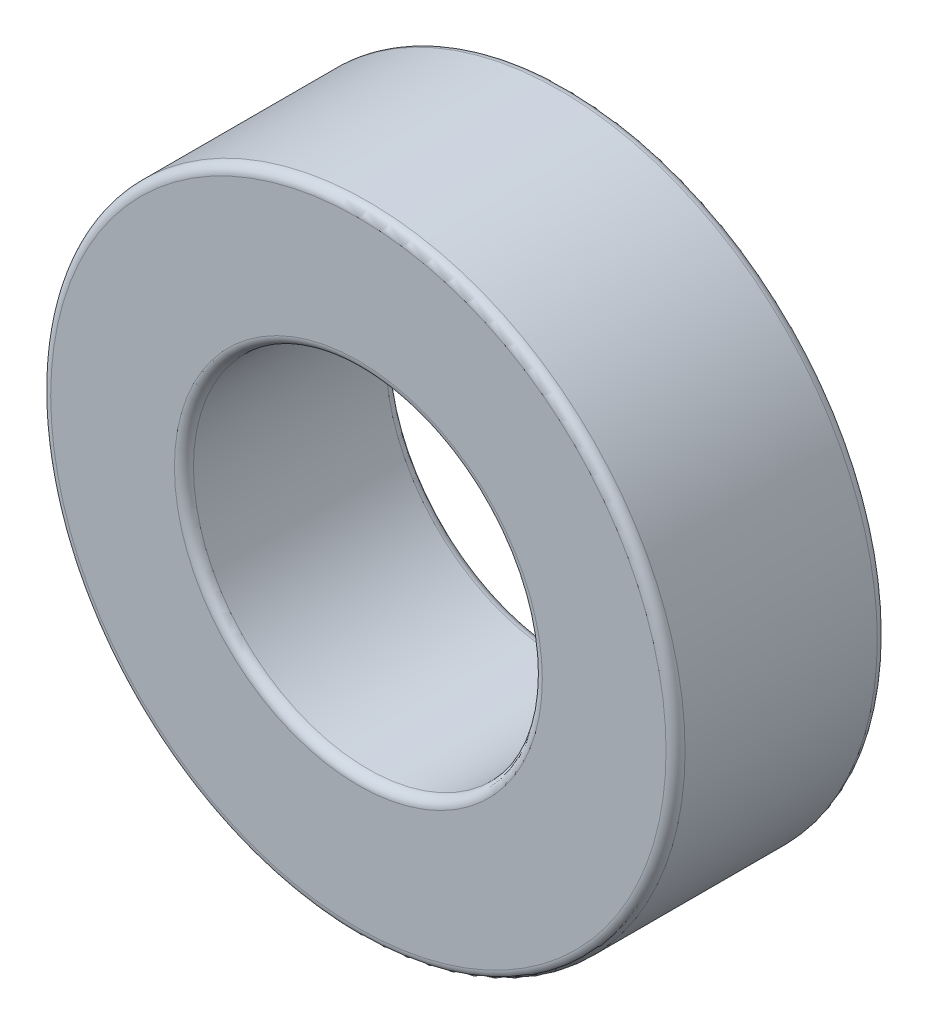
ISO-10303-21;
HEADER;
FILE_DESCRIPTION(('STEP AP214'),'2;1');
FILE_NAME('part.step','',(''),(''),'','','');
FILE_SCHEMA(('AUTOMOTIVE_DESIGN { 1 0 10303 214 1 1 1 1 }'));
ENDSEC;
DATA;
#1=APPLICATION_CONTEXT('core data for automotive mechanical design processes');
#2=APPLICATION_PROTOCOL_DEFINITION('international standard','automotive_design',2000,#1);
#3=PRODUCT_CONTEXT('',#1,'mechanical');
#4=PRODUCT('Part','Part','',(#3));
#5=PRODUCT_RELATED_PRODUCT_CATEGORY('part','',(#4));
#6=PRODUCT_DEFINITION_FORMATION('','',#4);
#7=PRODUCT_DEFINITION_CONTEXT('part definition',#1,'design');
#8=PRODUCT_DEFINITION('design','',#6,#7);
#9=PRODUCT_DEFINITION_SHAPE('','',#8);
#10=(LENGTH_UNIT() NAMED_UNIT(*) SI_UNIT(.MILLI.,.METRE.));
#11=(NAMED_UNIT(*) PLANE_ANGLE_UNIT() SI_UNIT($,.RADIAN.));
#12=(NAMED_UNIT(*) SI_UNIT($,.STERADIAN.) SOLID_ANGLE_UNIT());
#13=UNCERTAINTY_MEASURE_WITH_UNIT(LENGTH_MEASURE(1.E-05),#10,'distance_accuracy_value','');
#14=(GEOMETRIC_REPRESENTATION_CONTEXT(3) GLOBAL_UNCERTAINTY_ASSIGNED_CONTEXT((#13)) GLOBAL_UNIT_ASSIGNED_CONTEXT((#10,
#11,#12)) REPRESENTATION_CONTEXT('',''));
#15=CARTESIAN_POINT('',(0.,0.,0.));
#16=DIRECTION('',(0.,0.,1.));
#17=DIRECTION('',(1.,0.,0.));
#18=AXIS2_PLACEMENT_3D('',#15,#16,#17);
#19=CARTESIAN_POINT('',(0.,0.,-31.8));
#20=DIRECTION('',(0.,0.,1.));
#21=DIRECTION('',(1.,0.,0.));
#22=AXIS2_PLACEMENT_3D('',#19,#20,#21);
#23=TOROIDAL_SURFACE('',#22,48.5,1.50000000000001);
#24=CARTESIAN_POINT('',(0.,0.,-31.8));
#25=DIRECTION('',(0.,0.,1.));
#26=DIRECTION('',(1.,0.,0.));
#27=AXIS2_PLACEMENT_3D('',#24,#25,#26);
#28=CIRCLE('',#27,50.);
#29=CARTESIAN_POINT('',(50.,0.,-31.8));
#30=VERTEX_POINT('',#29);
#31=EDGE_CURVE('E10',#30,#30,#28,.T.);
#32=ORIENTED_EDGE('',*,*,#31,.F.);
#33=EDGE_LOOP('',(#32));
#34=FACE_BOUND('',#33,.T.);
#35=CARTESIAN_POINT('',(0.,0.,-33.3));
#36=DIRECTION('',(0.,0.,1.));
#37=DIRECTION('',(1.,0.,0.));
#38=AXIS2_PLACEMENT_3D('',#35,#36,#37);
#39=CIRCLE('',#38,48.5);
#40=CARTESIAN_POINT('',(48.5,0.,-33.3));
#41=VERTEX_POINT('',#40);
#42=EDGE_CURVE('E470',#41,#41,#39,.T.);
#43=ORIENTED_EDGE('',*,*,#42,.T.);
#44=EDGE_LOOP('',(#43));
#45=FACE_BOUND('',#44,.T.);
#46=ADVANCED_FACE('F442',(#34,#45),#23,.T.);
#47=CARTESIAN_POINT('',(0.,0.,112.247372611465));
#48=DIRECTION('',(0.,0.,1.));
#49=DIRECTION('',(1.,0.,0.));
#50=AXIS2_PLACEMENT_3D('',#47,#48,#49);
#51=CYLINDRICAL_SURFACE('',#50,50.);
#52=CARTESIAN_POINT('',(0.,0.,-1.5));
#53=DIRECTION('',(0.,0.,1.));
#54=DIRECTION('',(1.,0.,0.));
#55=AXIS2_PLACEMENT_3D('',#52,#53,#54);
#56=CIRCLE('',#55,50.);
#57=CARTESIAN_POINT('',(50.,0.,-1.5));
#58=VERTEX_POINT('',#57);
#59=EDGE_CURVE('E448',#58,#58,#56,.T.);
#60=ORIENTED_EDGE('',*,*,#59,.F.);
#61=EDGE_LOOP('',(#60));
#62=FACE_BOUND('',#61,.T.);
#63=ORIENTED_EDGE('',*,*,#31,.T.);
#64=EDGE_LOOP('',(#63));
#65=FACE_BOUND('',#64,.T.);
#66=ADVANCED_FACE('F585',(#62,#65),#51,.T.);
#67=CARTESIAN_POINT('',(0.,0.,-1.5));
#68=DIRECTION('',(0.,0.,1.));
#69=DIRECTION('',(1.,0.,0.));
#70=AXIS2_PLACEMENT_3D('',#67,#68,#69);
#71=TOROIDAL_SURFACE('',#70,48.5,1.50000000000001);
#72=ORIENTED_EDGE('',*,*,#59,.T.);
#73=EDGE_LOOP('',(#72));
#74=FACE_BOUND('',#73,.T.);
#75=CARTESIAN_POINT('',(0.,0.,0.));
#76=DIRECTION('',(0.,0.,1.));
#77=DIRECTION('',(1.,0.,0.));
#78=AXIS2_PLACEMENT_3D('',#75,#76,#77);
#79=CIRCLE('',#78,48.5);
#80=CARTESIAN_POINT('',(48.5,0.,0.));
#81=VERTEX_POINT('',#80);
#82=EDGE_CURVE('E452',#81,#81,#79,.T.);
#83=ORIENTED_EDGE('',*,*,#82,.F.);
#84=EDGE_LOOP('',(#83));
#85=FACE_BOUND('',#84,.T.);
#86=ADVANCED_FACE('F582',(#74,#85),#71,.T.);
#87=CARTESIAN_POINT('',(0.,48.5,0.));
#88=DIRECTION('',(0.,0.,-1.));
#89=DIRECTION('',(-1.,0.,0.));
#90=AXIS2_PLACEMENT_3D('',#87,#88,#89);
#91=PLANE('',#90);
#92=CARTESIAN_POINT('',(0.,0.,0.));
#93=DIRECTION('',(0.,0.,1.));
#94=DIRECTION('',(1.,0.,0.));
#95=AXIS2_PLACEMENT_3D('',#92,#93,#94);
#96=CIRCLE('',#95,29.);
#97=CARTESIAN_POINT('',(29.,0.,0.));
#98=VERTEX_POINT('',#97);
#99=EDGE_CURVE('E456',#98,#98,#96,.T.);
#100=ORIENTED_EDGE('',*,*,#99,.F.);
#101=EDGE_LOOP('',(#100));
#102=FACE_BOUND('',#101,.T.);
#103=ORIENTED_EDGE('',*,*,#82,.T.);
#104=EDGE_LOOP('',(#103));
#105=FACE_BOUND('',#104,.T.);
#106=ADVANCED_FACE('F578',(#102,#105),#91,.F.);
#107=CARTESIAN_POINT('',(0.,0.,-1.5));
#108=DIRECTION('',(0.,0.,1.));
#109=DIRECTION('',(1.,0.,0.));
#110=AXIS2_PLACEMENT_3D('',#107,#108,#109);
#111=TOROIDAL_SURFACE('',#110,29.,1.50000000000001);
#112=CARTESIAN_POINT('',(0.,0.,-1.5));
#113=DIRECTION('',(0.,0.,1.));
#114=DIRECTION('',(1.,0.,0.));
#115=AXIS2_PLACEMENT_3D('',#112,#113,#114);
#116=CIRCLE('',#115,27.5);
#117=CARTESIAN_POINT('',(27.5,0.,-1.5));
#118=VERTEX_POINT('',#117);
#119=EDGE_CURVE('E461',#118,#118,#116,.T.);
#120=ORIENTED_EDGE('',*,*,#119,.F.);
#121=EDGE_LOOP('',(#120));
#122=FACE_BOUND('',#121,.T.);
#123=ORIENTED_EDGE('',*,*,#99,.T.);
#124=EDGE_LOOP('',(#123));
#125=FACE_BOUND('',#124,.T.);
#126=ADVANCED_FACE('F574',(#122,#125),#111,.T.);
#127=CARTESIAN_POINT('',(0.,0.,112.247372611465));
#128=DIRECTION('',(0.,0.,1.));
#129=DIRECTION('',(1.,0.,0.));
#130=AXIS2_PLACEMENT_3D('',#127,#128,#129);
#131=CYLINDRICAL_SURFACE('',#130,27.5);
#132=ORIENTED_EDGE('',*,*,#119,.T.);
#133=EDGE_LOOP('',(#132));
#134=FACE_BOUND('',#133,.T.);
#135=CARTESIAN_POINT('',(0.,0.,-31.8));
#136=DIRECTION('',(0.,0.,1.));
#137=DIRECTION('',(1.,0.,0.));
#138=AXIS2_PLACEMENT_3D('',#135,#136,#137);
#139=CIRCLE('',#138,27.5);
#140=CARTESIAN_POINT('',(27.5,0.,-31.8));
#141=VERTEX_POINT('',#140);
#142=EDGE_CURVE('E464',#141,#141,#139,.T.);
#143=ORIENTED_EDGE('',*,*,#142,.F.);
#144=EDGE_LOOP('',(#143));
#145=FACE_BOUND('',#144,.T.);
#146=ADVANCED_FACE('F570',(#134,#145),#131,.F.);
#147=CARTESIAN_POINT('',(0.,0.,-31.8));
#148=DIRECTION('',(0.,0.,1.));
#149=DIRECTION('',(1.,0.,0.));
#150=AXIS2_PLACEMENT_3D('',#147,#148,#149);
#151=TOROIDAL_SURFACE('',#150,29.,1.50000000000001);
#152=ORIENTED_EDGE('',*,*,#142,.T.);
#153=EDGE_LOOP('',(#152));
#154=FACE_BOUND('',#153,.T.);
#155=CARTESIAN_POINT('',(0.,0.,-33.3));
#156=DIRECTION('',(0.,0.,1.));
#157=DIRECTION('',(1.,0.,0.));
#158=AXIS2_PLACEMENT_3D('',#155,#156,#157);
#159=CIRCLE('',#158,29.);
#160=CARTESIAN_POINT('',(29.,0.,-33.3));
#161=VERTEX_POINT('',#160);
#162=EDGE_CURVE('E467',#161,#161,#159,.T.);
#163=ORIENTED_EDGE('',*,*,#162,.F.);
#164=EDGE_LOOP('',(#163));
#165=FACE_BOUND('',#164,.T.);
#166=ADVANCED_FACE('F566',(#154,#165),#151,.T.);
#167=CARTESIAN_POINT('',(0.,48.5,-33.3));
#168=DIRECTION('',(0.,0.,-1.));
#169=DIRECTION('',(-1.,0.,0.));
#170=AXIS2_PLACEMENT_3D('',#167,#168,#169);
#171=PLANE('',#170);
#172=ORIENTED_EDGE('',*,*,#162,.T.);
#173=EDGE_LOOP('',(#172));
#174=FACE_BOUND('',#173,.T.);
#175=ORIENTED_EDGE('',*,*,#42,.F.);
#176=EDGE_LOOP('',(#175));
#177=FACE_BOUND('',#176,.T.);
#178=ADVANCED_FACE('F563',(#174,#177),#171,.T.);
#179=CLOSED_SHELL('',(#46,#66,#86,#106,#126,#146,#166,#178));
#180=CARTESIAN_POINT('',(0.,0.,-16.65));
#181=DIRECTION('',(0.,0.,-1.));
#182=DIRECTION('',(-1.,0.,0.));
#183=AXIS2_PLACEMENT_3D('',#180,#181,#182);
#184=CONICAL_SURFACE('',#183,38.7558140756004,0.535562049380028);
#185=CARTESIAN_POINT('',(0.,0.,-23.3031484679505));
#186=DIRECTION('',(0.,0.,1.));
#187=DIRECTION('',(1.,0.,0.));
#188=AXIS2_PLACEMENT_3D('',#185,#186,#187);
#189=CIRCLE('',#188,42.7038789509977);
#190=CARTESIAN_POINT('',(42.7038789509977,0.,-23.3031484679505));
#191=VERTEX_POINT('',#190);
#192=EDGE_CURVE('E536',#191,#191,#189,.T.);
#193=ORIENTED_EDGE('',*,*,#192,.F.);
#194=EDGE_LOOP('',(#193));
#195=FACE_BOUND('',#194,.T.);
#196=CARTESIAN_POINT('',(0.,0.,-16.65));
#197=DIRECTION('',(0.,0.,1.));
#198=DIRECTION('',(1.,0.,0.));
#199=AXIS2_PLACEMENT_3D('',#196,#197,#198);
#200=CIRCLE('',#199,38.7558140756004);
#201=CARTESIAN_POINT('',(38.7558140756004,0.,-16.65));
#202=VERTEX_POINT('',#201);
#203=EDGE_CURVE('E473',#202,#202,#200,.T.);
#204=ORIENTED_EDGE('',*,*,#203,.T.);
#205=EDGE_LOOP('',(#204));
#206=FACE_BOUND('',#205,.T.);
#207=ADVANCED_FACE('F542',(#195,#206),#184,.F.);
#208=CARTESIAN_POINT('',(0.,0.,-16.65));
#209=DIRECTION('',(0.,0.,1.));
#210=DIRECTION('',(1.,0.,0.));
#211=AXIS2_PLACEMENT_3D('',#208,#209,#210);
#212=CONICAL_SURFACE('',#211,38.7558140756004,0.535562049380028);
#213=CARTESIAN_POINT('',(0.,0.,-9.99685153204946));
#214=DIRECTION('',(0.,0.,1.));
#215=DIRECTION('',(1.,0.,0.));
#216=AXIS2_PLACEMENT_3D('',#213,#214,#215);
#217=CIRCLE('',#216,42.7038789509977);
#218=CARTESIAN_POINT('',(42.7038789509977,0.,-9.99685153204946));
#219=VERTEX_POINT('',#218);
#220=EDGE_CURVE('E476',#219,#219,#217,.T.);
#221=ORIENTED_EDGE('',*,*,#220,.T.);
#222=EDGE_LOOP('',(#221));
#223=FACE_BOUND('',#222,.T.);
#224=ORIENTED_EDGE('',*,*,#203,.F.);
#225=EDGE_LOOP('',(#224));
#226=FACE_BOUND('',#225,.T.);
#227=ADVANCED_FACE('F545',(#223,#226),#212,.F.);
#228=CARTESIAN_POINT('',(0.,0.,-9.99685153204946));
#229=DIRECTION('',(0.,0.,-1.));
#230=DIRECTION('',(-1.,0.,0.));
#231=AXIS2_PLACEMENT_3D('',#228,#229,#230);
#232=CONICAL_SURFACE('',#231,42.7038789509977,1.03523427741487);
#233=CARTESIAN_POINT('',(0.,0.,-12.1185255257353));
#234=DIRECTION('',(0.,0.,1.));
#235=DIRECTION('',(1.,0.,0.));
#236=AXIS2_PLACEMENT_3D('',#233,#234,#235);
#237=CIRCLE('',#236,46.279253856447);
#238=CARTESIAN_POINT('',(46.279253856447,0.,-12.1185255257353));
#239=VERTEX_POINT('',#238);
#240=EDGE_CURVE('E479',#239,#239,#237,.T.);
#241=ORIENTED_EDGE('',*,*,#240,.T.);
#242=EDGE_LOOP('',(#241));
#243=FACE_BOUND('',#242,.T.);
#244=ORIENTED_EDGE('',*,*,#220,.F.);
#245=EDGE_LOOP('',(#244));
#246=FACE_BOUND('',#245,.T.);
#247=ADVANCED_FACE('F551',(#243,#246),#232,.T.);
#248=CARTESIAN_POINT('',(0.,0.,-12.1185255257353));
#249=DIRECTION('',(0.,0.,1.));
#250=DIRECTION('',(1.,0.,0.));
#251=AXIS2_PLACEMENT_3D('',#248,#249,#250);
#252=CONICAL_SURFACE('',#251,46.279253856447,0.535562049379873);
#253=CARTESIAN_POINT('',(0.,0.,-12.1099257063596));
#254=DIRECTION('',(0.,0.,1.));
#255=DIRECTION('',(1.,0.,0.));
#256=AXIS2_PLACEMENT_3D('',#253,#254,#255);
#257=CIRCLE('',#256,46.2843571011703);
#258=CARTESIAN_POINT('',(46.2843571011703,0.,-12.1099257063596));
#259=VERTEX_POINT('',#258);
#260=EDGE_CURVE('E482',#259,#259,#257,.T.);
#261=ORIENTED_EDGE('',*,*,#260,.T.);
#262=EDGE_LOOP('',(#261));
#263=FACE_BOUND('',#262,.T.);
#264=ORIENTED_EDGE('',*,*,#240,.F.);
#265=EDGE_LOOP('',(#264));
#266=FACE_BOUND('',#265,.T.);
#267=ADVANCED_FACE('F557',(#263,#266),#252,.F.);
#268=CARTESIAN_POINT('',(0.,0.,-9.98825171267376));
#269=DIRECTION('',(0.,0.,-1.));
#270=DIRECTION('',(-1.,0.,0.));
#271=AXIS2_PLACEMENT_3D('',#268,#269,#270);
#272=CONICAL_SURFACE('',#271,42.7089821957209,1.03523427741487);
#273=ORIENTED_EDGE('',*,*,#260,.F.);
#274=EDGE_LOOP('',(#273));
#275=FACE_BOUND('',#274,.T.);
#276=CARTESIAN_POINT('',(0.,0.,-9.98825171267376));
#277=DIRECTION('',(0.,0.,1.));
#278=DIRECTION('',(1.,0.,0.));
#279=AXIS2_PLACEMENT_3D('',#276,#277,#278);
#280=CIRCLE('',#279,42.7089821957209);
#281=CARTESIAN_POINT('',(42.7089821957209,0.,-9.98825171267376));
#282=VERTEX_POINT('',#281);
#283=EDGE_CURVE('E485',#282,#282,#280,.T.);
#284=ORIENTED_EDGE('',*,*,#283,.T.);
#285=EDGE_LOOP('',(#284));
#286=FACE_BOUND('',#285,.T.);
#287=ADVANCED_FACE('F640',(#275,#286),#272,.F.);
#288=CARTESIAN_POINT('',(0.,0.,-3.33510324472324));
#289=DIRECTION('',(0.,0.,1.));
#290=DIRECTION('',(1.,0.,0.));
#291=AXIS2_PLACEMENT_3D('',#288,#289,#290);
#292=CONICAL_SURFACE('',#291,46.6570470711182,0.535562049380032);
#293=ORIENTED_EDGE('',*,*,#283,.F.);
#294=EDGE_LOOP('',(#293));
#295=FACE_BOUND('',#294,.T.);
#296=CARTESIAN_POINT('',(0.,0.,-3.33510324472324));
#297=DIRECTION('',(0.,0.,1.));
#298=DIRECTION('',(1.,0.,0.));
#299=AXIS2_PLACEMENT_3D('',#296,#297,#298);
#300=CIRCLE('',#299,46.6570470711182);
#301=CARTESIAN_POINT('',(46.6570470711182,0.,-3.33510324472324));
#302=VERTEX_POINT('',#301);
#303=EDGE_CURVE('E488',#302,#302,#300,.T.);
#304=ORIENTED_EDGE('',*,*,#303,.T.);
#305=EDGE_LOOP('',(#304));
#306=FACE_BOUND('',#305,.T.);
#307=ADVANCED_FACE('F647',(#295,#306),#292,.F.);
#308=CARTESIAN_POINT('',(0.,0.,-3.32999999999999));
#309=DIRECTION('',(0.,0.,-1.));
#310=DIRECTION('',(-1.,0.,0.));
#311=AXIS2_PLACEMENT_3D('',#308,#309,#310);
#312=CONICAL_SURFACE('',#311,46.6484472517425,1.0352342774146);
#313=ORIENTED_EDGE('',*,*,#303,.F.);
#314=EDGE_LOOP('',(#313));
#315=FACE_BOUND('',#314,.T.);
#316=CARTESIAN_POINT('',(0.,0.,-3.32999999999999));
#317=DIRECTION('',(0.,0.,1.));
#318=DIRECTION('',(1.,0.,0.));
#319=AXIS2_PLACEMENT_3D('',#316,#317,#318);
#320=CIRCLE('',#319,46.6484472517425);
#321=CARTESIAN_POINT('',(46.6484472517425,0.,-3.32999999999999));
#322=VERTEX_POINT('',#321);
#323=EDGE_CURVE('E491',#322,#322,#320,.T.);
#324=ORIENTED_EDGE('',*,*,#323,.T.);
#325=EDGE_LOOP('',(#324));
#326=FACE_BOUND('',#325,.T.);
#327=ADVANCED_FACE('F655',(#315,#326),#312,.F.);
#328=CARTESIAN_POINT('',(0.,0.,-3.32999999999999));
#329=DIRECTION('',(0.,0.,1.));
#330=DIRECTION('',(1.,0.,0.));
#331=AXIS2_PLACEMENT_3D('',#328,#329,#330);
#332=CONICAL_SURFACE('',#331,46.6484472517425,0.535562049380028);
#333=CARTESIAN_POINT('',(0.,0.,-9.98314846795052));
#334=DIRECTION('',(0.,0.,1.));
#335=DIRECTION('',(1.,0.,0.));
#336=AXIS2_PLACEMENT_3D('',#333,#334,#335);
#337=CIRCLE('',#336,42.7003823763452);
#338=CARTESIAN_POINT('',(42.7003823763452,0.,-9.98314846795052));
#339=VERTEX_POINT('',#338);
#340=EDGE_CURVE('E494',#339,#339,#337,.T.);
#341=ORIENTED_EDGE('',*,*,#340,.T.);
#342=EDGE_LOOP('',(#341));
#343=FACE_BOUND('',#342,.T.);
#344=ORIENTED_EDGE('',*,*,#323,.F.);
#345=EDGE_LOOP('',(#344));
#346=FACE_BOUND('',#345,.T.);
#347=ADVANCED_FACE('F663',(#343,#346),#332,.T.);
#348=CARTESIAN_POINT('',(0.,0.,-9.98314846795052));
#349=DIRECTION('',(0.,0.,-1.));
#350=DIRECTION('',(-1.,0.,0.));
#351=AXIS2_PLACEMENT_3D('',#348,#349,#350);
#352=CONICAL_SURFACE('',#351,42.7003823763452,1.03523427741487);
#353=CARTESIAN_POINT('',(0.,0.,-7.86147447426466));
#354=DIRECTION('',(0.,0.,1.));
#355=DIRECTION('',(1.,0.,0.));
#356=AXIS2_PLACEMENT_3D('',#353,#354,#355);
#357=CIRCLE('',#356,39.1250074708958);
#358=CARTESIAN_POINT('',(39.1250074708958,0.,-7.86147447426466));
#359=VERTEX_POINT('',#358);
#360=EDGE_CURVE('E497',#359,#359,#357,.T.);
#361=ORIENTED_EDGE('',*,*,#360,.T.);
#362=EDGE_LOOP('',(#361));
#363=FACE_BOUND('',#362,.T.);
#364=ORIENTED_EDGE('',*,*,#340,.F.);
#365=EDGE_LOOP('',(#364));
#366=FACE_BOUND('',#365,.T.);
#367=ADVANCED_FACE('F671',(#363,#366),#352,.F.);
#368=CARTESIAN_POINT('',(0.,0.,-7.87007429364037));
#369=DIRECTION('',(0.,0.,1.));
#370=DIRECTION('',(1.,0.,0.));
#371=AXIS2_PLACEMENT_3D('',#368,#369,#370);
#372=CONICAL_SURFACE('',#371,39.1199042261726,0.53556204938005);
#373=ORIENTED_EDGE('',*,*,#360,.F.);
#374=EDGE_LOOP('',(#373));
#375=FACE_BOUND('',#374,.T.);
#376=CARTESIAN_POINT('',(0.,0.,-7.87007429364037));
#377=DIRECTION('',(0.,0.,1.));
#378=DIRECTION('',(1.,0.,0.));
#379=AXIS2_PLACEMENT_3D('',#376,#377,#378);
#380=CIRCLE('',#379,39.1199042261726);
#381=CARTESIAN_POINT('',(39.1199042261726,0.,-7.87007429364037));
#382=VERTEX_POINT('',#381);
#383=EDGE_CURVE('E500',#382,#382,#380,.T.);
#384=ORIENTED_EDGE('',*,*,#383,.T.);
#385=EDGE_LOOP('',(#384));
#386=FACE_BOUND('',#385,.T.);
#387=ADVANCED_FACE('F679',(#375,#386),#372,.T.);
#388=CARTESIAN_POINT('',(0.,0.,-9.99174828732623));
#389=DIRECTION('',(0.,0.,-1.));
#390=DIRECTION('',(-1.,0.,0.));
#391=AXIS2_PLACEMENT_3D('',#388,#389,#390);
#392=CONICAL_SURFACE('',#391,42.695279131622,1.03523427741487);
#393=ORIENTED_EDGE('',*,*,#383,.F.);
#394=EDGE_LOOP('',(#393));
#395=FACE_BOUND('',#394,.T.);
#396=CARTESIAN_POINT('',(0.,0.,-9.99174828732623));
#397=DIRECTION('',(0.,0.,1.));
#398=DIRECTION('',(1.,0.,0.));
#399=AXIS2_PLACEMENT_3D('',#396,#397,#398);
#400=CIRCLE('',#399,42.695279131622);
#401=CARTESIAN_POINT('',(42.695279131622,0.,-9.99174828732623));
#402=VERTEX_POINT('',#401);
#403=EDGE_CURVE('E503',#402,#402,#400,.T.);
#404=ORIENTED_EDGE('',*,*,#403,.T.);
#405=EDGE_LOOP('',(#404));
#406=FACE_BOUND('',#405,.T.);
#407=ADVANCED_FACE('F687',(#395,#406),#392,.T.);
#408=CARTESIAN_POINT('',(0.,0.,-16.65));
#409=DIRECTION('',(0.,0.,1.));
#410=DIRECTION('',(1.,0.,0.));
#411=AXIS2_PLACEMENT_3D('',#408,#409,#410);
#412=CONICAL_SURFACE('',#411,38.7441859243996,0.535562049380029);
#413=ORIENTED_EDGE('',*,*,#403,.F.);
#414=EDGE_LOOP('',(#413));
#415=FACE_BOUND('',#414,.T.);
#416=CARTESIAN_POINT('',(0.,0.,-16.65));
#417=DIRECTION('',(0.,0.,1.));
#418=DIRECTION('',(1.,0.,0.));
#419=AXIS2_PLACEMENT_3D('',#416,#417,#418);
#420=CIRCLE('',#419,38.7441859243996);
#421=CARTESIAN_POINT('',(38.7441859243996,0.,-16.65));
#422=VERTEX_POINT('',#421);
#423=EDGE_CURVE('E506',#422,#422,#420,.T.);
#424=ORIENTED_EDGE('',*,*,#423,.T.);
#425=EDGE_LOOP('',(#424));
#426=FACE_BOUND('',#425,.T.);
#427=ADVANCED_FACE('F695',(#415,#426),#412,.T.);
#428=CARTESIAN_POINT('',(0.,0.,-16.65));
#429=DIRECTION('',(0.,0.,-1.));
#430=DIRECTION('',(-1.,0.,0.));
#431=AXIS2_PLACEMENT_3D('',#428,#429,#430);
#432=CONICAL_SURFACE('',#431,38.7441859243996,0.535562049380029);
#433=CARTESIAN_POINT('',(0.,0.,-23.3082517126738));
#434=DIRECTION('',(0.,0.,1.));
#435=DIRECTION('',(1.,0.,0.));
#436=AXIS2_PLACEMENT_3D('',#433,#434,#435);
#437=CIRCLE('',#436,42.695279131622);
#438=CARTESIAN_POINT('',(42.695279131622,0.,-23.3082517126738));
#439=VERTEX_POINT('',#438);
#440=EDGE_CURVE('E509',#439,#439,#437,.T.);
#441=ORIENTED_EDGE('',*,*,#440,.T.);
#442=EDGE_LOOP('',(#441));
#443=FACE_BOUND('',#442,.T.);
#444=ORIENTED_EDGE('',*,*,#423,.F.);
#445=EDGE_LOOP('',(#444));
#446=FACE_BOUND('',#445,.T.);
#447=ADVANCED_FACE('F703',(#443,#446),#432,.T.);
#448=CARTESIAN_POINT('',(0.,0.,-23.3082517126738));
#449=DIRECTION('',(0.,0.,1.));
#450=DIRECTION('',(1.,0.,0.));
#451=AXIS2_PLACEMENT_3D('',#448,#449,#450);
#452=CONICAL_SURFACE('',#451,42.695279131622,1.03523427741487);
#453=CARTESIAN_POINT('',(0.,0.,-25.4299257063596));
#454=DIRECTION('',(0.,0.,1.));
#455=DIRECTION('',(1.,0.,0.));
#456=AXIS2_PLACEMENT_3D('',#453,#454,#455);
#457=CIRCLE('',#456,39.1199042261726);
#458=CARTESIAN_POINT('',(39.1199042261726,0.,-25.4299257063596));
#459=VERTEX_POINT('',#458);
#460=EDGE_CURVE('E512',#459,#459,#457,.T.);
#461=ORIENTED_EDGE('',*,*,#460,.T.);
#462=EDGE_LOOP('',(#461));
#463=FACE_BOUND('',#462,.T.);
#464=ORIENTED_EDGE('',*,*,#440,.F.);
#465=EDGE_LOOP('',(#464));
#466=FACE_BOUND('',#465,.T.);
#467=ADVANCED_FACE('F711',(#463,#466),#452,.T.);
#468=CARTESIAN_POINT('',(0.,0.,-25.4299257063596));
#469=DIRECTION('',(0.,0.,-1.));
#470=DIRECTION('',(-1.,0.,0.));
#471=AXIS2_PLACEMENT_3D('',#468,#469,#470);
#472=CONICAL_SURFACE('',#471,39.1199042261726,0.53556204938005);
#473=CARTESIAN_POINT('',(0.,0.,-25.4385255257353));
#474=DIRECTION('',(0.,0.,1.));
#475=DIRECTION('',(1.,0.,0.));
#476=AXIS2_PLACEMENT_3D('',#473,#474,#475);
#477=CIRCLE('',#476,39.1250074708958);
#478=CARTESIAN_POINT('',(39.1250074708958,0.,-25.4385255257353));
#479=VERTEX_POINT('',#478);
#480=EDGE_CURVE('E515',#479,#479,#477,.T.);
#481=ORIENTED_EDGE('',*,*,#480,.T.);
#482=EDGE_LOOP('',(#481));
#483=FACE_BOUND('',#482,.T.);
#484=ORIENTED_EDGE('',*,*,#460,.F.);
#485=EDGE_LOOP('',(#484));
#486=FACE_BOUND('',#485,.T.);
#487=ADVANCED_FACE('F719',(#483,#486),#472,.T.);
#488=CARTESIAN_POINT('',(0.,0.,-23.3168515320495));
#489=DIRECTION('',(0.,0.,1.));
#490=DIRECTION('',(1.,0.,0.));
#491=AXIS2_PLACEMENT_3D('',#488,#489,#490);
#492=CONICAL_SURFACE('',#491,42.7003823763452,1.03523427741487);
#493=ORIENTED_EDGE('',*,*,#480,.F.);
#494=EDGE_LOOP('',(#493));
#495=FACE_BOUND('',#494,.T.);
#496=CARTESIAN_POINT('',(0.,0.,-23.3168515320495));
#497=DIRECTION('',(0.,0.,1.));
#498=DIRECTION('',(1.,0.,0.));
#499=AXIS2_PLACEMENT_3D('',#496,#497,#498);
#500=CIRCLE('',#499,42.7003823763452);
#501=CARTESIAN_POINT('',(42.7003823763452,0.,-23.3168515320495));
#502=VERTEX_POINT('',#501);
#503=EDGE_CURVE('E518',#502,#502,#500,.T.);
#504=ORIENTED_EDGE('',*,*,#503,.T.);
#505=EDGE_LOOP('',(#504));
#506=FACE_BOUND('',#505,.T.);
#507=ADVANCED_FACE('F727',(#495,#506),#492,.F.);
#508=CARTESIAN_POINT('',(0.,0.,-29.97));
#509=DIRECTION('',(0.,0.,-1.));
#510=DIRECTION('',(-1.,0.,0.));
#511=AXIS2_PLACEMENT_3D('',#508,#509,#510);
#512=CONICAL_SURFACE('',#511,46.6484472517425,0.535562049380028);
#513=ORIENTED_EDGE('',*,*,#503,.F.);
#514=EDGE_LOOP('',(#513));
#515=FACE_BOUND('',#514,.T.);
#516=CARTESIAN_POINT('',(0.,0.,-29.97));
#517=DIRECTION('',(0.,0.,1.));
#518=DIRECTION('',(1.,0.,0.));
#519=AXIS2_PLACEMENT_3D('',#516,#517,#518);
#520=CIRCLE('',#519,46.6484472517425);
#521=CARTESIAN_POINT('',(46.6484472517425,0.,-29.97));
#522=VERTEX_POINT('',#521);
#523=EDGE_CURVE('E521',#522,#522,#520,.T.);
#524=ORIENTED_EDGE('',*,*,#523,.T.);
#525=EDGE_LOOP('',(#524));
#526=FACE_BOUND('',#525,.T.);
#527=ADVANCED_FACE('F735',(#515,#526),#512,.T.);
#528=CARTESIAN_POINT('',(0.,0.,-29.9648967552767));
#529=DIRECTION('',(0.,0.,1.));
#530=DIRECTION('',(1.,0.,0.));
#531=AXIS2_PLACEMENT_3D('',#528,#529,#530);
#532=CONICAL_SURFACE('',#531,46.6570470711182,1.0352342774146);
#533=ORIENTED_EDGE('',*,*,#523,.F.);
#534=EDGE_LOOP('',(#533));
#535=FACE_BOUND('',#534,.T.);
#536=CARTESIAN_POINT('',(0.,0.,-29.9648967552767));
#537=DIRECTION('',(0.,0.,1.));
#538=DIRECTION('',(1.,0.,0.));
#539=AXIS2_PLACEMENT_3D('',#536,#537,#538);
#540=CIRCLE('',#539,46.6570470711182);
#541=CARTESIAN_POINT('',(46.6570470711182,0.,-29.9648967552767));
#542=VERTEX_POINT('',#541);
#543=EDGE_CURVE('E524',#542,#542,#540,.T.);
#544=ORIENTED_EDGE('',*,*,#543,.T.);
#545=EDGE_LOOP('',(#544));
#546=FACE_BOUND('',#545,.T.);
#547=ADVANCED_FACE('F743',(#535,#546),#532,.F.);
#548=CARTESIAN_POINT('',(0.,0.,-29.9648967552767));
#549=DIRECTION('',(0.,0.,-1.));
#550=DIRECTION('',(-1.,0.,0.));
#551=AXIS2_PLACEMENT_3D('',#548,#549,#550);
#552=CONICAL_SURFACE('',#551,46.6570470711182,0.535562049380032);
#553=CARTESIAN_POINT('',(0.,0.,-23.3117482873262));
#554=DIRECTION('',(0.,0.,1.));
#555=DIRECTION('',(1.,0.,0.));
#556=AXIS2_PLACEMENT_3D('',#553,#554,#555);
#557=CIRCLE('',#556,42.7089821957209);
#558=CARTESIAN_POINT('',(42.7089821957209,0.,-23.3117482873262));
#559=VERTEX_POINT('',#558);
#560=EDGE_CURVE('E527',#559,#559,#557,.T.);
#561=ORIENTED_EDGE('',*,*,#560,.T.);
#562=EDGE_LOOP('',(#561));
#563=FACE_BOUND('',#562,.T.);
#564=ORIENTED_EDGE('',*,*,#543,.F.);
#565=EDGE_LOOP('',(#564));
#566=FACE_BOUND('',#565,.T.);
#567=ADVANCED_FACE('F751',(#563,#566),#552,.F.);
#568=CARTESIAN_POINT('',(0.,0.,-23.3117482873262));
#569=DIRECTION('',(0.,0.,1.));
#570=DIRECTION('',(1.,0.,0.));
#571=AXIS2_PLACEMENT_3D('',#568,#569,#570);
#572=CONICAL_SURFACE('',#571,42.7089821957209,1.03523427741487);
#573=CARTESIAN_POINT('',(0.,0.,-21.1900742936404));
#574=DIRECTION('',(0.,0.,1.));
#575=DIRECTION('',(1.,0.,0.));
#576=AXIS2_PLACEMENT_3D('',#573,#574,#575);
#577=CIRCLE('',#576,46.2843571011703);
#578=CARTESIAN_POINT('',(46.2843571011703,0.,-21.1900742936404));
#579=VERTEX_POINT('',#578);
#580=EDGE_CURVE('E530',#579,#579,#577,.T.);
#581=ORIENTED_EDGE('',*,*,#580,.T.);
#582=EDGE_LOOP('',(#581));
#583=FACE_BOUND('',#582,.T.);
#584=ORIENTED_EDGE('',*,*,#560,.F.);
#585=EDGE_LOOP('',(#584));
#586=FACE_BOUND('',#585,.T.);
#587=ADVANCED_FACE('F759',(#583,#586),#572,.F.);
#588=CARTESIAN_POINT('',(0.,0.,-21.1814744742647));
#589=DIRECTION('',(0.,0.,-1.));
#590=DIRECTION('',(-1.,0.,0.));
#591=AXIS2_PLACEMENT_3D('',#588,#589,#590);
#592=CONICAL_SURFACE('',#591,46.279253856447,0.535562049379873);
#593=ORIENTED_EDGE('',*,*,#580,.F.);
#594=EDGE_LOOP('',(#593));
#595=FACE_BOUND('',#594,.T.);
#596=CARTESIAN_POINT('',(0.,0.,-21.1814744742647));
#597=DIRECTION('',(0.,0.,1.));
#598=DIRECTION('',(1.,0.,0.));
#599=AXIS2_PLACEMENT_3D('',#596,#597,#598);
#600=CIRCLE('',#599,46.279253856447);
#601=CARTESIAN_POINT('',(46.279253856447,0.,-21.1814744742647));
#602=VERTEX_POINT('',#601);
#603=EDGE_CURVE('E533',#602,#602,#600,.T.);
#604=ORIENTED_EDGE('',*,*,#603,.T.);
#605=EDGE_LOOP('',(#604));
#606=FACE_BOUND('',#605,.T.);
#607=ADVANCED_FACE('F767',(#595,#606),#592,.F.);
#608=CARTESIAN_POINT('',(0.,0.,-23.3031484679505));
#609=DIRECTION('',(0.,0.,1.));
#610=DIRECTION('',(1.,0.,0.));
#611=AXIS2_PLACEMENT_3D('',#608,#609,#610);
#612=CONICAL_SURFACE('',#611,42.7038789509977,1.03523427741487);
#613=ORIENTED_EDGE('',*,*,#603,.F.);
#614=EDGE_LOOP('',(#613));
#615=FACE_BOUND('',#614,.T.);
#616=ORIENTED_EDGE('',*,*,#192,.T.);
#617=EDGE_LOOP('',(#616));
#618=FACE_BOUND('',#617,.T.);
#619=ADVANCED_FACE('F540',(#615,#618),#612,.T.);
#620=CLOSED_SHELL('',(#207,#227,#247,#267,#287,#307,#327,#347,#367,#387,#407,#427,#447,#467,
#487,#507,#527,#547,#567,#587,#607,#619));
#621=ORIENTED_CLOSED_SHELL('',*,#620,.T.);
#622=BREP_WITH_VOIDS('B2',#179,(#621));
#623=ADVANCED_BREP_SHAPE_REPRESENTATION('',(#18,#622),#14);
#624=SHAPE_DEFINITION_REPRESENTATION(#9,#623);
ENDSEC;
END-ISO-10303-21;
